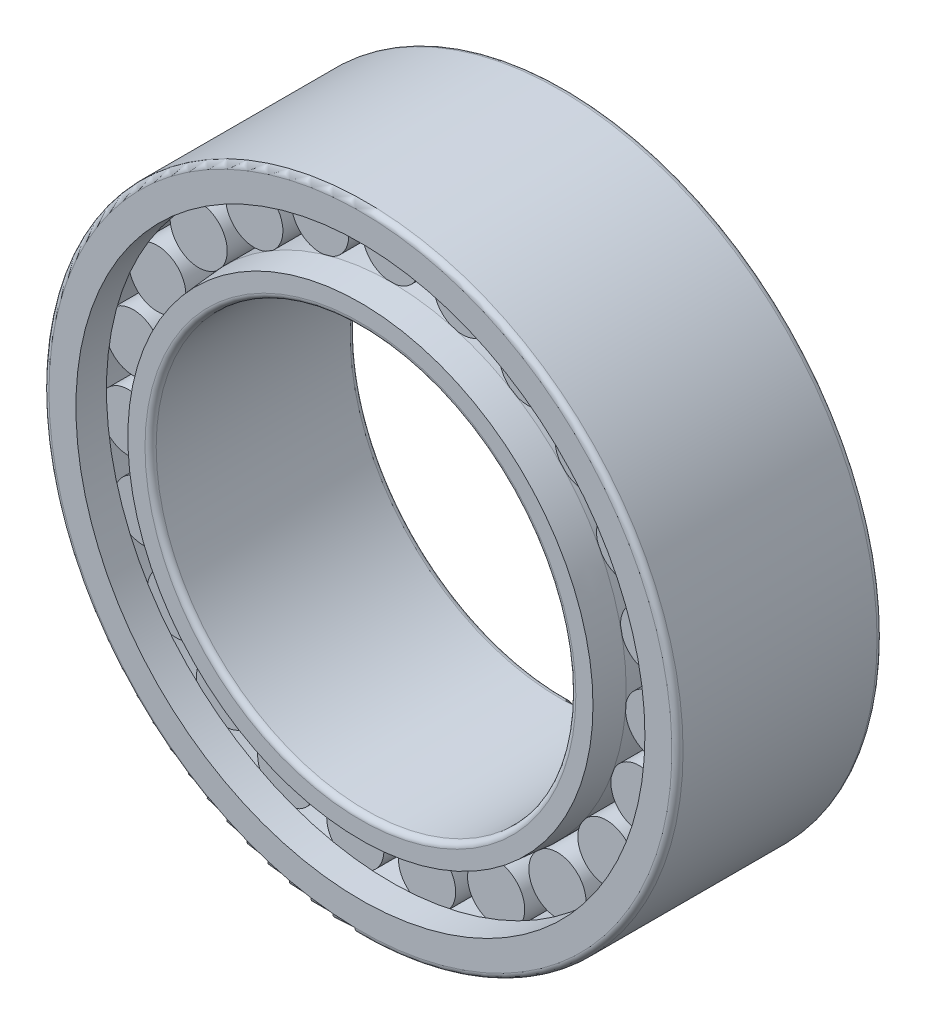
from build123d import *

# Parameters (mm, degrees)
BASESKE_W            = 15.4
BASESKE_H            = 3.066666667
FILLET1_R            = 0.6
CIRPATTERNBALL_COUNT = 23


with BuildPart() as part:
    # BaseSke → Roller (revolve)
    with BuildSketch(Plane(origin=(0, 0, 0), x_dir=(0, 0, -1), z_dir=(1, 0, 0))):
        with Locations((0, 26.716666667)):
            Rectangle(BASESKE_W, BASESKE_H)
    roller = revolve(axis=Axis((0, 28.25, 7.7), (0, 0, -1)))

    # OuterRaceSke → OuterRace (revolve)
    with BuildSketch(Plane(origin=(0, 0, 0), x_dir=(0, 0, -1), z_dir=(1, 0, 0)), mode=Mode.PRIVATE) as outerrace_sk:
        Polygon((-11, 34), (11, 34), (11, 30.508), (7.725, 30.508), (7.725, 31.274666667), (-7.725, 31.274666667), (-7.725, 30.508), (-11, 30.508), align=None)
    revolve(outerrace_sk.sketch.rotate(Axis((0, 0, 50.391616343), (0, 0, -1)), 90), axis=Axis((0, 0, 50.391616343), (0, 0, -1)))

    # InnerRaceSke → InnerRace (revolve)
    with BuildSketch(Plane(origin=(0, 0, 0), x_dir=(0, 0, -1), z_dir=(1, 0, 0)), mode=Mode.PRIVATE) as innerrace_sk:
        Polygon((-11, 22.5), (11, 22.5), (11, 25.992), (7.725, 25.992), (7.725, 25.225333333), (-7.725, 25.225333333), (-7.725, 25.992), (-11, 25.992), align=None)
    revolve(innerrace_sk.sketch.rotate(Axis((0, 0, 70.862590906), (0, 0, -1)), 90), axis=Axis((0, 0, 70.862590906), (0, 0, -1)))

    # Fillet1
    fillet1_edges = [part.edges().sort_by_distance(p)[0] for p in [
        (-34, 0, 11),
        (-34, 0, -11),
        (-22.5, 0, -11),
        (-22.5, 0, 11),
    ]]
    fillet(fillet1_edges, radius=FILLET1_R)

    # NJSke → NJ (revolve, cut)
    with BuildSketch(Plane(origin=(0, 0, 0), x_dir=(0, 0, -1), z_dir=(1, 0, 0)), mode=Mode.PRIVATE) as nj_sk:
        Polygon((11, 25.992), (7.725, 25.992), (7.725, 25.225333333), (11, 24.93880796), align=None)
    nj = revolve(nj_sk.sketch.rotate(Axis((0, 0, 35.607790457), (0, 0, -1)), 270), axis=Axis((0, 0, 35.607790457), (0, 0, -1)), mode=Mode.SUBTRACT)

    # NU: NJ across plane
    add(nj.mirror(Plane.XY), mode=Mode.SUBTRACT)

    # CirPatternBall: Roller ×23 about axis
    cirpatternball_axis = Axis((0, 0, 0), (0, 0, 1))
    for i in range(1, CIRPATTERNBALL_COUNT):
        add(roller.rotate(cirpatternball_axis, i * 360 / CIRPATTERNBALL_COUNT))


solid = part.part
